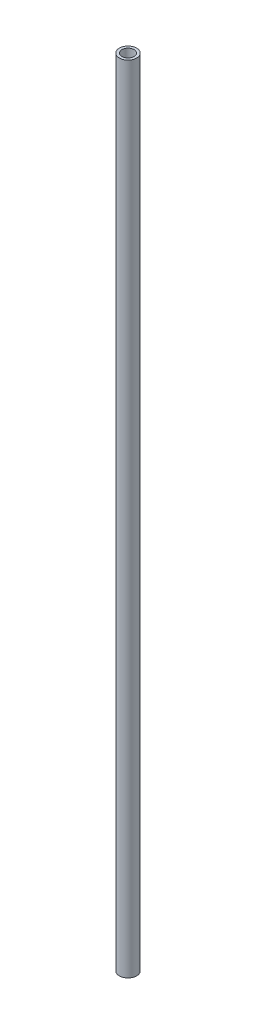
ISO-10303-21;
HEADER;
FILE_DESCRIPTION(('STEP AP214'),'2;1');
FILE_NAME('part.step','',(''),(''),'','','');
FILE_SCHEMA(('AUTOMOTIVE_DESIGN { 1 0 10303 214 1 1 1 1 }'));
ENDSEC;
DATA;
#1=APPLICATION_CONTEXT('core data for automotive mechanical design processes');
#2=APPLICATION_PROTOCOL_DEFINITION('international standard','automotive_design',2000,#1);
#3=PRODUCT_CONTEXT('',#1,'mechanical');
#4=PRODUCT('Part','Part','',(#3));
#5=PRODUCT_RELATED_PRODUCT_CATEGORY('part','',(#4));
#6=PRODUCT_DEFINITION_FORMATION('','',#4);
#7=PRODUCT_DEFINITION_CONTEXT('part definition',#1,'design');
#8=PRODUCT_DEFINITION('design','',#6,#7);
#9=PRODUCT_DEFINITION_SHAPE('','',#8);
#10=(LENGTH_UNIT() NAMED_UNIT(*) SI_UNIT(.MILLI.,.METRE.));
#11=(NAMED_UNIT(*) PLANE_ANGLE_UNIT() SI_UNIT($,.RADIAN.));
#12=(NAMED_UNIT(*) SI_UNIT($,.STERADIAN.) SOLID_ANGLE_UNIT());
#13=UNCERTAINTY_MEASURE_WITH_UNIT(LENGTH_MEASURE(1.E-05),#10,'distance_accuracy_value','');
#14=(GEOMETRIC_REPRESENTATION_CONTEXT(3) GLOBAL_UNCERTAINTY_ASSIGNED_CONTEXT((#13)) GLOBAL_UNIT_ASSIGNED_CONTEXT((#10,
#11,#12)) REPRESENTATION_CONTEXT('',''));
#15=CARTESIAN_POINT('',(0.,0.,0.));
#16=DIRECTION('',(0.,0.,1.));
#17=DIRECTION('',(1.,0.,0.));
#18=AXIS2_PLACEMENT_3D('',#15,#16,#17);
#19=CARTESIAN_POINT('',(0.,115.,0.));
#20=DIRECTION('',(0.,1.,0.));
#21=DIRECTION('',(0.,0.,1.));
#22=AXIS2_PLACEMENT_3D('',#19,#20,#21);
#23=PLANE('',#22);
#24=CARTESIAN_POINT('',(0.,115.,0.));
#25=DIRECTION('',(0.,1.,0.));
#26=DIRECTION('',(0.,0.,1.));
#27=AXIS2_PLACEMENT_3D('',#24,#25,#26);
#28=CIRCLE('',#27,1.25);
#29=CARTESIAN_POINT('',(0.,115.,1.25));
#30=VERTEX_POINT('',#29);
#31=EDGE_CURVE('E10',#30,#30,#28,.T.);
#32=ORIENTED_EDGE('',*,*,#31,.T.);
#33=EDGE_LOOP('',(#32));
#34=FACE_BOUND('',#33,.T.);
#35=CARTESIAN_POINT('',(0.,115.,0.));
#36=DIRECTION('',(0.,1.,0.));
#37=DIRECTION('',(0.,0.,1.));
#38=AXIS2_PLACEMENT_3D('',#35,#36,#37);
#39=CIRCLE('',#38,0.875);
#40=CARTESIAN_POINT('',(0.,115.,0.875));
#41=VERTEX_POINT('',#40);
#42=EDGE_CURVE('E44',#41,#41,#39,.T.);
#43=ORIENTED_EDGE('',*,*,#42,.F.);
#44=EDGE_LOOP('',(#43));
#45=FACE_BOUND('',#44,.T.);
#46=ADVANCED_FACE('F33',(#34,#45),#23,.T.);
#47=CARTESIAN_POINT('',(0.,0.,0.));
#48=DIRECTION('',(0.,1.,0.));
#49=DIRECTION('',(0.,0.,1.));
#50=AXIS2_PLACEMENT_3D('',#47,#48,#49);
#51=PLANE('',#50);
#52=CARTESIAN_POINT('',(0.,0.,0.));
#53=DIRECTION('',(0.,1.,0.));
#54=DIRECTION('',(0.,0.,1.));
#55=AXIS2_PLACEMENT_3D('',#52,#53,#54);
#56=CIRCLE('',#55,1.25);
#57=CARTESIAN_POINT('',(0.,0.,1.25));
#58=VERTEX_POINT('',#57);
#59=EDGE_CURVE('E37',#58,#58,#56,.T.);
#60=ORIENTED_EDGE('',*,*,#59,.F.);
#61=EDGE_LOOP('',(#60));
#62=FACE_BOUND('',#61,.T.);
#63=CARTESIAN_POINT('',(0.,0.,0.));
#64=DIRECTION('',(0.,1.,0.));
#65=DIRECTION('',(0.,0.,1.));
#66=AXIS2_PLACEMENT_3D('',#63,#64,#65);
#67=CIRCLE('',#66,0.875);
#68=CARTESIAN_POINT('',(0.,0.,0.875));
#69=VERTEX_POINT('',#68);
#70=EDGE_CURVE('E46',#69,#69,#67,.T.);
#71=ORIENTED_EDGE('',*,*,#70,.T.);
#72=EDGE_LOOP('',(#71));
#73=FACE_BOUND('',#72,.T.);
#74=ADVANCED_FACE('F56',(#62,#73),#51,.F.);
#75=CARTESIAN_POINT('',(0.,115.,0.));
#76=DIRECTION('',(0.,-1.,0.));
#77=DIRECTION('',(0.,0.,-1.));
#78=AXIS2_PLACEMENT_3D('',#75,#76,#77);
#79=CYLINDRICAL_SURFACE('',#78,1.25);
#80=ORIENTED_EDGE('',*,*,#31,.F.);
#81=EDGE_LOOP('',(#80));
#82=FACE_BOUND('',#81,.T.);
#83=ORIENTED_EDGE('',*,*,#59,.T.);
#84=EDGE_LOOP('',(#83));
#85=FACE_BOUND('',#84,.T.);
#86=ADVANCED_FACE('F35',(#82,#85),#79,.T.);
#87=CARTESIAN_POINT('',(0.,115.,0.));
#88=DIRECTION('',(0.,-1.,0.));
#89=DIRECTION('',(0.,0.,-1.));
#90=AXIS2_PLACEMENT_3D('',#87,#88,#89);
#91=CYLINDRICAL_SURFACE('',#90,0.875);
#92=ORIENTED_EDGE('',*,*,#42,.T.);
#93=EDGE_LOOP('',(#92));
#94=FACE_BOUND('',#93,.T.);
#95=ORIENTED_EDGE('',*,*,#70,.F.);
#96=EDGE_LOOP('',(#95));
#97=FACE_BOUND('',#96,.T.);
#98=ADVANCED_FACE('F52',(#94,#97),#91,.F.);
#99=CLOSED_SHELL('',(#46,#74,#86,#98));
#100=MANIFOLD_SOLID_BREP('B2',#99);
#101=ADVANCED_BREP_SHAPE_REPRESENTATION('',(#18,#100),#14);
#102=SHAPE_DEFINITION_REPRESENTATION(#9,#101);
ENDSEC;
END-ISO-10303-21;
